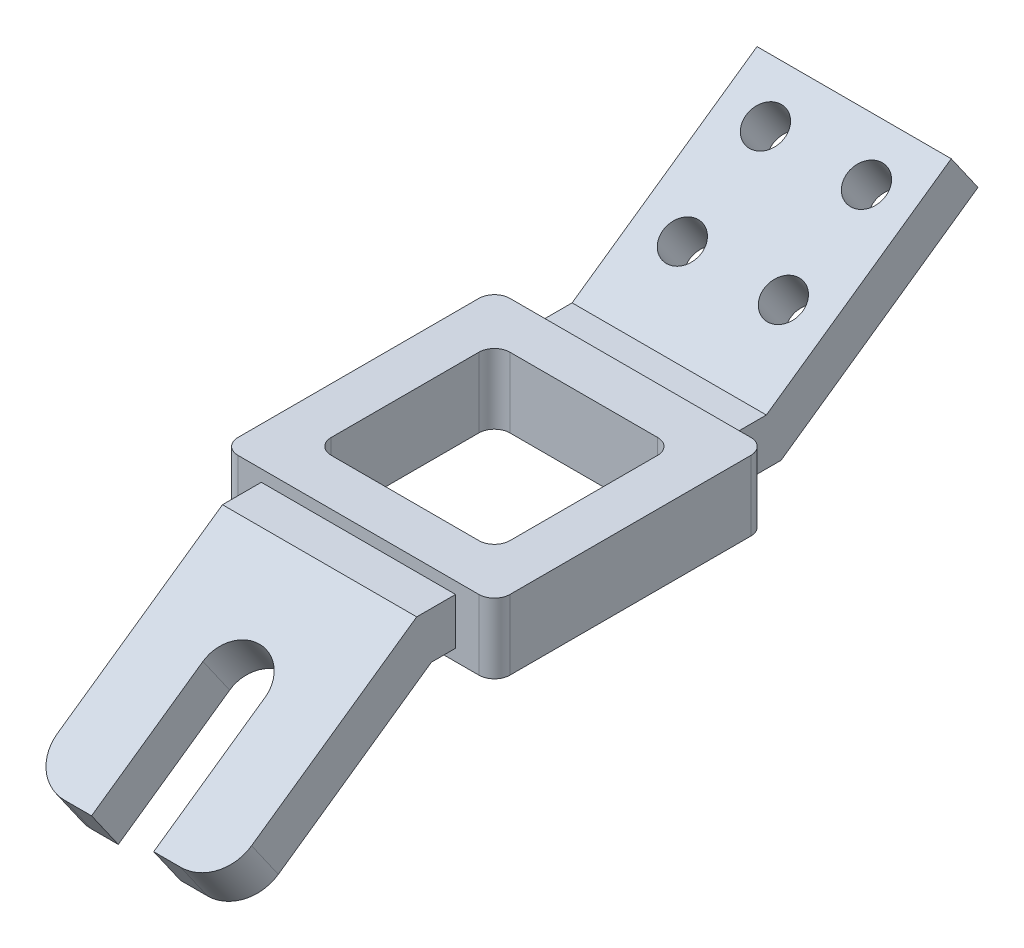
ISO-10303-21;
HEADER;
FILE_DESCRIPTION(('STEP AP214'),'2;1');
FILE_NAME('part.step','',(''),(''),'','','');
FILE_SCHEMA(('AUTOMOTIVE_DESIGN { 1 0 10303 214 1 1 1 1 }'));
ENDSEC;
DATA;
#1=APPLICATION_CONTEXT('core data for automotive mechanical design processes');
#2=APPLICATION_PROTOCOL_DEFINITION('international standard','automotive_design',2000,#1);
#3=PRODUCT_CONTEXT('',#1,'mechanical');
#4=PRODUCT('Part','Part','',(#3));
#5=PRODUCT_RELATED_PRODUCT_CATEGORY('part','',(#4));
#6=PRODUCT_DEFINITION_FORMATION('','',#4);
#7=PRODUCT_DEFINITION_CONTEXT('part definition',#1,'design');
#8=PRODUCT_DEFINITION('design','',#6,#7);
#9=PRODUCT_DEFINITION_SHAPE('','',#8);
#10=(LENGTH_UNIT() NAMED_UNIT(*) SI_UNIT(.MILLI.,.METRE.));
#11=(NAMED_UNIT(*) PLANE_ANGLE_UNIT() SI_UNIT($,.RADIAN.));
#12=(NAMED_UNIT(*) SI_UNIT($,.STERADIAN.) SOLID_ANGLE_UNIT());
#13=UNCERTAINTY_MEASURE_WITH_UNIT(LENGTH_MEASURE(1.E-05),#10,'distance_accuracy_value','');
#14=(GEOMETRIC_REPRESENTATION_CONTEXT(3) GLOBAL_UNCERTAINTY_ASSIGNED_CONTEXT((#13)) GLOBAL_UNIT_ASSIGNED_CONTEXT((#10,
#11,#12)) REPRESENTATION_CONTEXT('',''));
#15=CARTESIAN_POINT('',(0.,0.,0.));
#16=DIRECTION('',(0.,0.,1.));
#17=DIRECTION('',(1.,0.,0.));
#18=AXIS2_PLACEMENT_3D('',#15,#16,#17);
#19=CARTESIAN_POINT('',(31.75,-49.9484630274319,115.198733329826));
#20=DIRECTION('',(0.,-0.573576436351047,0.819152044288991));
#21=DIRECTION('',(0.,-0.819152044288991,-0.573576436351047));
#22=AXIS2_PLACEMENT_3D('',#19,#20,#21);
#23=PLANE('',#22);
#24=DIRECTION('',(0.,0.819152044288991,0.573576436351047));
#25=VECTOR('',#24,1.);
#26=CARTESIAN_POINT('',(-10.16,-162.306932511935,36.5244860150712));
#27=LINE('',#26,#25);
#28=CARTESIAN_POINT('',(-10.16,-49.9484630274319,115.198733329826));
#29=VERTEX_POINT('',#28);
#30=CARTESIAN_POINT('',(-10.16,-37.4645858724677,123.940038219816));
#31=VERTEX_POINT('',#30);
#32=EDGE_CURVE('E404',#29,#31,#27,.T.);
#33=ORIENTED_EDGE('',*,*,#32,.T.);
#34=DIRECTION('',(-1.,0.,0.));
#35=VECTOR('',#34,1.);
#36=CARTESIAN_POINT('',(31.75,-37.4645858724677,123.940038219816));
#37=LINE('',#36,#35);
#38=CARTESIAN_POINT('',(-19.05,-37.4645858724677,123.940038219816));
#39=VERTEX_POINT('',#38);
#40=EDGE_CURVE('E273',#31,#39,#37,.T.);
#41=ORIENTED_EDGE('',*,*,#40,.T.);
#42=DIRECTION('',(0.,0.819152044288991,0.573576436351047));
#43=VECTOR('',#42,1.);
#44=CARTESIAN_POINT('',(-19.05,-49.9484630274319,115.198733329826));
#45=LINE('',#44,#43);
#46=CARTESIAN_POINT('',(-19.05,-49.9484630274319,115.198733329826));
#47=VERTEX_POINT('',#46);
#48=EDGE_CURVE('E387',#39,#47,#45,.F.);
#49=ORIENTED_EDGE('',*,*,#48,.T.);
#50=DIRECTION('',(-1.,0.,0.));
#51=VECTOR('',#50,1.);
#52=CARTESIAN_POINT('',(31.75,-49.9484630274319,115.198733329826));
#53=LINE('',#52,#51);
#54=EDGE_CURVE('E506',#29,#47,#53,.T.);
#55=ORIENTED_EDGE('',*,*,#54,.F.);
#56=EDGE_LOOP('',(#33,#41,#49,#55));
#57=FACE_BOUND('',#56,.T.);
#58=ADVANCED_FACE('F26',(#57),#23,.T.);
#59=CARTESIAN_POINT('',(31.75,7.62,57.15));
#60=DIRECTION('',(0.,1.,0.));
#61=DIRECTION('',(0.,0.,1.));
#62=AXIS2_PLACEMENT_3D('',#59,#60,#61);
#63=PLANE('',#62);
#64=DIRECTION('',(0.,0.,-1.));
#65=VECTOR('',#64,1.);
#66=CARTESIAN_POINT('',(31.75,7.62,57.15));
#67=LINE('',#66,#65);
#68=CARTESIAN_POINT('',(31.75,7.62,59.5525767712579));
#69=VERTEX_POINT('',#68);
#70=CARTESIAN_POINT('',(31.75,7.62,46.8525767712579));
#71=VERTEX_POINT('',#70);
#72=EDGE_CURVE('E491',#69,#71,#67,.T.);
#73=ORIENTED_EDGE('',*,*,#72,.T.);
#74=DIRECTION('',(-1.,0.,0.));
#75=VECTOR('',#74,1.);
#76=CARTESIAN_POINT('',(31.75,7.62,46.8525767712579));
#77=LINE('',#76,#75);
#78=CARTESIAN_POINT('',(-31.75,7.62,46.8525767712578));
#79=VERTEX_POINT('',#78);
#80=EDGE_CURVE('E456',#71,#79,#77,.T.);
#81=ORIENTED_EDGE('',*,*,#80,.T.);
#82=DIRECTION('',(0.,0.,-1.));
#83=VECTOR('',#82,1.);
#84=CARTESIAN_POINT('',(-31.75,7.62,57.15));
#85=LINE('',#84,#83);
#86=CARTESIAN_POINT('',(-31.75,7.62,59.5525767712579));
#87=VERTEX_POINT('',#86);
#88=EDGE_CURVE('E471',#87,#79,#85,.T.);
#89=ORIENTED_EDGE('',*,*,#88,.F.);
#90=DIRECTION('',(-1.,0.,0.));
#91=VECTOR('',#90,1.);
#92=CARTESIAN_POINT('',(31.75,7.62,59.5525767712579));
#93=LINE('',#92,#91);
#94=EDGE_CURVE('E272',#69,#87,#93,.T.);
#95=ORIENTED_EDGE('',*,*,#94,.F.);
#96=EDGE_LOOP('',(#73,#81,#89,#95));
#97=FACE_BOUND('',#96,.T.);
#98=ADVANCED_FACE('F519',(#97),#63,.T.);
#99=CARTESIAN_POINT('',(31.75,-7.62,57.15));
#100=DIRECTION('',(0.,1.,0.));
#101=DIRECTION('',(0.,0.,1.));
#102=AXIS2_PLACEMENT_3D('',#99,#100,#101);
#103=PLANE('',#102);
#104=DIRECTION('',(-1.,0.,0.));
#105=VECTOR('',#104,1.);
#106=CARTESIAN_POINT('',(31.75,-7.62,46.8525767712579));
#107=LINE('',#106,#105);
#108=CARTESIAN_POINT('',(31.75,-7.62,46.8525767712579));
#109=VERTEX_POINT('',#108);
#110=CARTESIAN_POINT('',(-31.75,-7.62,46.8525767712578));
#111=VERTEX_POINT('',#110);
#112=EDGE_CURVE('E454',#109,#111,#107,.T.);
#113=ORIENTED_EDGE('',*,*,#112,.F.);
#114=DIRECTION('',(0.,0.,-1.));
#115=VECTOR('',#114,1.);
#116=CARTESIAN_POINT('',(31.75,-7.62,57.15));
#117=LINE('',#116,#115);
#118=CARTESIAN_POINT('',(31.75,-7.62,54.7474232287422));
#119=VERTEX_POINT('',#118);
#120=EDGE_CURVE('E499',#119,#109,#117,.T.);
#121=ORIENTED_EDGE('',*,*,#120,.F.);
#122=DIRECTION('',(-1.,0.,0.));
#123=VECTOR('',#122,1.);
#124=CARTESIAN_POINT('',(31.75,-7.62,54.7474232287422));
#125=LINE('',#124,#123);
#126=CARTESIAN_POINT('',(-31.75,-7.62,54.7474232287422));
#127=VERTEX_POINT('',#126);
#128=EDGE_CURVE('E504',#119,#127,#125,.T.);
#129=ORIENTED_EDGE('',*,*,#128,.T.);
#130=DIRECTION('',(0.,0.,-1.));
#131=VECTOR('',#130,1.);
#132=CARTESIAN_POINT('',(-31.75,-7.62,57.15));
#133=LINE('',#132,#131);
#134=EDGE_CURVE('E479',#127,#111,#133,.T.);
#135=ORIENTED_EDGE('',*,*,#134,.T.);
#136=EDGE_LOOP('',(#113,#121,#129,#135));
#137=FACE_BOUND('',#136,.T.);
#138=ADVANCED_FACE('F622',(#137),#103,.F.);
#139=CARTESIAN_POINT('',(31.75,37.4645858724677,-123.940038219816));
#140=DIRECTION('',(-1.,0.,0.));
#141=DIRECTION('',(0.,0.,1.));
#142=AXIS2_PLACEMENT_3D('',#139,#140,#141);
#143=PLANE('',#142);
#144=DIRECTION('',(0.,0.573576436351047,-0.819152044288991));
#145=VECTOR('',#144,1.);
#146=CARTESIAN_POINT('',(31.75,-37.4645858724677,123.940038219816));
#147=LINE('',#146,#145);
#148=CARTESIAN_POINT('',(31.75,-30.1801651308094,113.536807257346));
#149=VERTEX_POINT('',#148);
#150=EDGE_CURVE('E494',#149,#69,#147,.T.);
#151=ORIENTED_EDGE('',*,*,#150,.F.);
#152=DIRECTION('',(0.,0.819152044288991,0.573576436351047));
#153=VECTOR('',#152,1.);
#154=CARTESIAN_POINT('',(31.75,-42.6640422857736,104.795502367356));
#155=LINE('',#154,#153);
#156=CARTESIAN_POINT('',(31.75,-42.6640422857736,104.795502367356));
#157=VERTEX_POINT('',#156);
#158=EDGE_CURVE('E49',#149,#157,#155,.F.);
#159=ORIENTED_EDGE('',*,*,#158,.T.);
#160=DIRECTION('',(0.,0.573576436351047,-0.819152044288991));
#161=VECTOR('',#160,1.);
#162=CARTESIAN_POINT('',(31.75,-49.9484630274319,115.198733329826));
#163=LINE('',#162,#161);
#164=EDGE_CURVE('E496',#157,#119,#163,.T.);
#165=ORIENTED_EDGE('',*,*,#164,.T.);
#166=ORIENTED_EDGE('',*,*,#120,.T.);
#167=DIRECTION('',(0.,-1.,0.));
#168=VECTOR('',#167,1.);
#169=CARTESIAN_POINT('',(31.75,37.4645858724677,46.8525767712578));
#170=LINE('',#169,#168);
#171=EDGE_CURVE('E459',#71,#109,#170,.T.);
#172=ORIENTED_EDGE('',*,*,#171,.F.);
#173=ORIENTED_EDGE('',*,*,#72,.F.);
#174=EDGE_LOOP('',(#151,#159,#165,#166,#172,#173));
#175=FACE_BOUND('',#174,.T.);
#176=ADVANCED_FACE('F516',(#175),#143,.F.);
#177=CARTESIAN_POINT('',(-31.75,37.4645858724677,-123.940038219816));
#178=DIRECTION('',(-1.,0.,0.));
#179=DIRECTION('',(0.,0.,1.));
#180=AXIS2_PLACEMENT_3D('',#177,#178,#179);
#181=PLANE('',#180);
#182=DIRECTION('',(0.,0.573576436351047,-0.819152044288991));
#183=VECTOR('',#182,1.);
#184=CARTESIAN_POINT('',(-31.75,-49.9484630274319,115.198733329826));
#185=LINE('',#184,#183);
#186=CARTESIAN_POINT('',(-31.75,-42.6640422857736,104.795502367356));
#187=VERTEX_POINT('',#186);
#188=EDGE_CURVE('E476',#187,#127,#185,.T.);
#189=ORIENTED_EDGE('',*,*,#188,.F.);
#190=DIRECTION('',(0.,0.819152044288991,0.573576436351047));
#191=VECTOR('',#190,1.);
#192=CARTESIAN_POINT('',(-31.75,-96.3674755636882,67.1919535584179));
#193=LINE('',#192,#191);
#194=CARTESIAN_POINT('',(-31.75,-30.1801651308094,113.536807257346));
#195=VERTEX_POINT('',#194);
#196=EDGE_CURVE('E378',#187,#195,#193,.T.);
#197=ORIENTED_EDGE('',*,*,#196,.T.);
#198=DIRECTION('',(0.,0.573576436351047,-0.819152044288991));
#199=VECTOR('',#198,1.);
#200=CARTESIAN_POINT('',(-31.75,-37.4645858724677,123.940038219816));
#201=LINE('',#200,#199);
#202=EDGE_CURVE('E474',#195,#87,#201,.T.);
#203=ORIENTED_EDGE('',*,*,#202,.T.);
#204=ORIENTED_EDGE('',*,*,#88,.T.);
#205=DIRECTION('',(0.,-1.,0.));
#206=VECTOR('',#205,1.);
#207=CARTESIAN_POINT('',(-31.75,37.4645858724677,46.8525767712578));
#208=LINE('',#207,#206);
#209=EDGE_CURVE('E291',#79,#111,#208,.T.);
#210=ORIENTED_EDGE('',*,*,#209,.T.);
#211=ORIENTED_EDGE('',*,*,#134,.F.);
#212=EDGE_LOOP('',(#189,#197,#203,#204,#210,#211));
#213=FACE_BOUND('',#212,.T.);
#214=ADVANCED_FACE('F526',(#213),#181,.T.);
#215=CARTESIAN_POINT('',(31.75,-37.4645858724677,123.940038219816));
#216=DIRECTION('',(0.,0.819152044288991,0.573576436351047));
#217=DIRECTION('',(0.,-0.573576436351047,0.819152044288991));
#218=AXIS2_PLACEMENT_3D('',#215,#216,#217);
#219=PLANE('',#218);
#220=DIRECTION('',(0.,-0.573576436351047,0.819152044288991));
#221=VECTOR('',#220,1.);
#222=CARTESIAN_POINT('',(-10.16,-37.4645858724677,123.940038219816));
#223=LINE('',#222,#221);
#224=CARTESIAN_POINT('',(-10.16,-11.9691132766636,87.5287298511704));
#225=VERTEX_POINT('',#224);
#226=EDGE_CURVE('E257',#225,#31,#223,.T.);
#227=ORIENTED_EDGE('',*,*,#226,.F.);
#228=CARTESIAN_POINT('',(0.,-11.9691132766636,87.5287298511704));
#229=DIRECTION('',(0.,0.819152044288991,0.573576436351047));
#230=DIRECTION('',(0.,0.573576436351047,-0.819152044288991));
#231=AXIS2_PLACEMENT_3D('',#228,#229,#230);
#232=CIRCLE('',#231,10.16);
#233=CARTESIAN_POINT('',(10.16,-11.9691132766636,87.5287298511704));
#234=VERTEX_POINT('',#233);
#235=EDGE_CURVE('E265',#234,#225,#232,.T.);
#236=ORIENTED_EDGE('',*,*,#235,.F.);
#237=DIRECTION('',(0.,0.573576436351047,-0.819152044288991));
#238=VECTOR('',#237,1.);
#239=CARTESIAN_POINT('',(10.16,-11.9691132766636,87.5287298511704));
#240=LINE('',#239,#238);
#241=CARTESIAN_POINT('',(10.16,-37.4645858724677,123.940038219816));
#242=VERTEX_POINT('',#241);
#243=EDGE_CURVE('E249',#242,#234,#240,.T.);
#244=ORIENTED_EDGE('',*,*,#243,.F.);
#245=CARTESIAN_POINT('',(19.05,-37.4645858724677,123.940038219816));
#246=VERTEX_POINT('',#245);
#247=EDGE_CURVE('E263',#246,#242,#37,.T.);
#248=ORIENTED_EDGE('',*,*,#247,.F.);
#249=CARTESIAN_POINT('',(19.05,-30.1801651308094,113.536807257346));
#250=DIRECTION('',(0.,0.819152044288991,0.573576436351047));
#251=DIRECTION('',(0.,-0.573576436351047,0.819152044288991));
#252=AXIS2_PLACEMENT_3D('',#249,#250,#251);
#253=CIRCLE('',#252,12.7);
#254=EDGE_CURVE('E381',#246,#149,#253,.T.);
#255=ORIENTED_EDGE('',*,*,#254,.T.);
#256=ORIENTED_EDGE('',*,*,#150,.T.);
#257=ORIENTED_EDGE('',*,*,#94,.T.);
#258=ORIENTED_EDGE('',*,*,#202,.F.);
#259=CARTESIAN_POINT('',(-19.05,-30.1801651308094,113.536807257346));
#260=DIRECTION('',(0.,0.819152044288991,0.573576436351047));
#261=DIRECTION('',(0.,-0.573576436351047,0.819152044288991));
#262=AXIS2_PLACEMENT_3D('',#259,#260,#261);
#263=CIRCLE('',#262,12.7);
#264=EDGE_CURVE('E383',#195,#39,#263,.T.);
#265=ORIENTED_EDGE('',*,*,#264,.T.);
#266=ORIENTED_EDGE('',*,*,#40,.F.);
#267=EDGE_LOOP('',(#227,#236,#244,#248,#255,#256,#257,#258,#265,#266));
#268=FACE_BOUND('',#267,.T.);
#269=ADVANCED_FACE('F262',(#268),#219,.T.);
#270=DIRECTION('',(0.,0.819152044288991,0.573576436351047));
#271=VECTOR('',#270,1.);
#272=CARTESIAN_POINT('',(10.16,-162.306932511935,36.5244860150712));
#273=LINE('',#272,#271);
#274=CARTESIAN_POINT('',(10.16,-49.9484630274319,115.198733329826));
#275=VERTEX_POINT('',#274);
#276=EDGE_CURVE('E246',#275,#242,#273,.T.);
#277=ORIENTED_EDGE('',*,*,#276,.F.);
#278=CARTESIAN_POINT('',(19.05,-49.9484630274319,115.198733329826));
#279=VERTEX_POINT('',#278);
#280=EDGE_CURVE('E278',#279,#275,#53,.T.);
#281=ORIENTED_EDGE('',*,*,#280,.F.);
#282=DIRECTION('',(0.,0.819152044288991,0.573576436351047));
#283=VECTOR('',#282,1.);
#284=CARTESIAN_POINT('',(19.05,-37.4645858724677,123.940038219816));
#285=LINE('',#284,#283);
#286=EDGE_CURVE('E271',#279,#246,#285,.T.);
#287=ORIENTED_EDGE('',*,*,#286,.T.);
#288=ORIENTED_EDGE('',*,*,#247,.T.);
#289=EDGE_LOOP('',(#277,#281,#287,#288));
#290=FACE_BOUND('',#289,.T.);
#291=ADVANCED_FACE('F269',(#290),#23,.T.);
#292=CARTESIAN_POINT('',(31.75,-49.9484630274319,115.198733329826));
#293=DIRECTION('',(0.,0.819152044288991,0.573576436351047));
#294=DIRECTION('',(0.,-0.573576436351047,0.819152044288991));
#295=AXIS2_PLACEMENT_3D('',#292,#293,#294);
#296=PLANE('',#295);
#297=CARTESIAN_POINT('',(0.,-24.4529904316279,78.7874249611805));
#298=DIRECTION('',(0.,0.819152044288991,0.573576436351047));
#299=DIRECTION('',(0.,-0.573576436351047,0.819152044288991));
#300=AXIS2_PLACEMENT_3D('',#297,#298,#299);
#301=CIRCLE('',#300,10.16);
#302=CARTESIAN_POINT('',(10.16,-24.4529904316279,78.7874249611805));
#303=VERTEX_POINT('',#302);
#304=CARTESIAN_POINT('',(-10.16,-24.4529904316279,78.7874249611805));
#305=VERTEX_POINT('',#304);
#306=EDGE_CURVE('E34',#303,#305,#301,.T.);
#307=ORIENTED_EDGE('',*,*,#306,.T.);
#308=DIRECTION('',(0.,-0.573576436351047,0.819152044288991));
#309=VECTOR('',#308,1.);
#310=CARTESIAN_POINT('',(-10.16,-49.9484630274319,115.198733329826));
#311=LINE('',#310,#309);
#312=EDGE_CURVE('E11',#305,#29,#311,.T.);
#313=ORIENTED_EDGE('',*,*,#312,.T.);
#314=ORIENTED_EDGE('',*,*,#54,.T.);
#315=CARTESIAN_POINT('',(-19.05,-42.6640422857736,104.795502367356));
#316=DIRECTION('',(0.,0.819152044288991,0.573576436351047));
#317=DIRECTION('',(0.,-0.573576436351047,0.819152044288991));
#318=AXIS2_PLACEMENT_3D('',#315,#316,#317);
#319=CIRCLE('',#318,12.7);
#320=EDGE_CURVE('E392',#47,#187,#319,.F.);
#321=ORIENTED_EDGE('',*,*,#320,.T.);
#322=ORIENTED_EDGE('',*,*,#188,.T.);
#323=ORIENTED_EDGE('',*,*,#128,.F.);
#324=ORIENTED_EDGE('',*,*,#164,.F.);
#325=CARTESIAN_POINT('',(19.05,-42.6640422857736,104.795502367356));
#326=DIRECTION('',(0.,0.819152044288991,0.573576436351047));
#327=DIRECTION('',(0.,-0.573576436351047,0.819152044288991));
#328=AXIS2_PLACEMENT_3D('',#325,#326,#327);
#329=CIRCLE('',#328,12.7);
#330=EDGE_CURVE('E390',#157,#279,#329,.F.);
#331=ORIENTED_EDGE('',*,*,#330,.T.);
#332=ORIENTED_EDGE('',*,*,#280,.T.);
#333=DIRECTION('',(0.,0.573576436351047,-0.819152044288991));
#334=VECTOR('',#333,1.);
#335=CARTESIAN_POINT('',(10.16,-49.9484630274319,115.198733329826));
#336=LINE('',#335,#334);
#337=EDGE_CURVE('E252',#275,#303,#336,.T.);
#338=ORIENTED_EDGE('',*,*,#337,.T.);
#339=EDGE_LOOP('',(#307,#313,#314,#321,#322,#323,#324,#331,#332,#338));
#340=FACE_BOUND('',#339,.T.);
#341=ADVANCED_FACE('F397',(#340),#296,.F.);
#342=CARTESIAN_POINT('',(-44.45,11.43,46.8525767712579));
#343=DIRECTION('',(0.,0.,-1.));
#344=DIRECTION('',(-1.,0.,0.));
#345=AXIS2_PLACEMENT_3D('',#342,#343,#344);
#346=PLANE('',#345);
#347=DIRECTION('',(1.,0.,0.));
#348=VECTOR('',#347,1.);
#349=CARTESIAN_POINT('',(-44.45,11.43,46.8525767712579));
#350=LINE('',#349,#348);
#351=CARTESIAN_POINT('',(-39.37,11.43,46.8525767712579));
#352=VERTEX_POINT('',#351);
#353=CARTESIAN_POINT('',(39.37,11.43,46.8525767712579));
#354=VERTEX_POINT('',#353);
#355=EDGE_CURVE('E438',#352,#354,#350,.T.);
#356=ORIENTED_EDGE('',*,*,#355,.F.);
#357=DIRECTION('',(0.,-1.,0.));
#358=VECTOR('',#357,1.);
#359=CARTESIAN_POINT('',(-39.37,11.43,46.8525767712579));
#360=LINE('',#359,#358);
#361=CARTESIAN_POINT('',(-39.37,-11.43,46.8525767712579));
#362=VERTEX_POINT('',#361);
#363=EDGE_CURVE('E322',#352,#362,#360,.T.);
#364=ORIENTED_EDGE('',*,*,#363,.T.);
#365=DIRECTION('',(1.,0.,0.));
#366=VECTOR('',#365,1.);
#367=CARTESIAN_POINT('',(-44.45,-11.43,46.8525767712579));
#368=LINE('',#367,#366);
#369=CARTESIAN_POINT('',(39.37,-11.43,46.8525767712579));
#370=VERTEX_POINT('',#369);
#371=EDGE_CURVE('E426',#362,#370,#368,.T.);
#372=ORIENTED_EDGE('',*,*,#371,.T.);
#373=DIRECTION('',(0.,-1.,0.));
#374=VECTOR('',#373,1.);
#375=CARTESIAN_POINT('',(39.37,11.43,46.8525767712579));
#376=LINE('',#375,#374);
#377=EDGE_CURVE('E320',#370,#354,#376,.F.);
#378=ORIENTED_EDGE('',*,*,#377,.T.);
#379=EDGE_LOOP('',(#356,#364,#372,#378));
#380=FACE_BOUND('',#379,.T.);
#381=ORIENTED_EDGE('',*,*,#80,.F.);
#382=ORIENTED_EDGE('',*,*,#171,.T.);
#383=ORIENTED_EDGE('',*,*,#112,.T.);
#384=ORIENTED_EDGE('',*,*,#209,.F.);
#385=EDGE_LOOP('',(#381,#382,#383,#384));
#386=FACE_BOUND('',#385,.T.);
#387=ADVANCED_FACE('F601',(#380,#386),#346,.F.);
#388=CARTESIAN_POINT('',(-44.45,11.43,-42.0474232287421));
#389=DIRECTION('',(0.,0.,1.));
#390=DIRECTION('',(1.,0.,0.));
#391=AXIS2_PLACEMENT_3D('',#388,#389,#390);
#392=PLANE('',#391);
#393=DIRECTION('',(-1.,0.,0.));
#394=VECTOR('',#393,1.);
#395=CARTESIAN_POINT('',(-44.45,-11.43,-42.0474232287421));
#396=LINE('',#395,#394);
#397=CARTESIAN_POINT('',(39.37,-11.43,-42.0474232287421));
#398=VERTEX_POINT('',#397);
#399=CARTESIAN_POINT('',(-39.37,-11.43,-42.0474232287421));
#400=VERTEX_POINT('',#399);
#401=EDGE_CURVE('E432',#398,#400,#396,.T.);
#402=ORIENTED_EDGE('',*,*,#401,.T.);
#403=DIRECTION('',(0.,-1.,0.));
#404=VECTOR('',#403,1.);
#405=CARTESIAN_POINT('',(-39.37,11.43,-42.0474232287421));
#406=LINE('',#405,#404);
#407=CARTESIAN_POINT('',(-39.37,11.43,-42.0474232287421));
#408=VERTEX_POINT('',#407);
#409=EDGE_CURVE('E310',#400,#408,#406,.F.);
#410=ORIENTED_EDGE('',*,*,#409,.T.);
#411=DIRECTION('',(-1.,0.,0.));
#412=VECTOR('',#411,1.);
#413=CARTESIAN_POINT('',(-44.45,11.43,-42.0474232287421));
#414=LINE('',#413,#412);
#415=CARTESIAN_POINT('',(39.37,11.43,-42.0474232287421));
#416=VERTEX_POINT('',#415);
#417=EDGE_CURVE('E444',#416,#408,#414,.T.);
#418=ORIENTED_EDGE('',*,*,#417,.F.);
#419=DIRECTION('',(0.,-1.,0.));
#420=VECTOR('',#419,1.);
#421=CARTESIAN_POINT('',(39.37,11.43,-42.0474232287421));
#422=LINE('',#421,#420);
#423=EDGE_CURVE('E307',#416,#398,#422,.T.);
#424=ORIENTED_EDGE('',*,*,#423,.T.);
#425=EDGE_LOOP('',(#402,#410,#418,#424));
#426=FACE_BOUND('',#425,.T.);
#427=DIRECTION('',(1.,0.,0.));
#428=VECTOR('',#427,1.);
#429=CARTESIAN_POINT('',(31.75,-7.62,-42.0474232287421));
#430=LINE('',#429,#428);
#431=CARTESIAN_POINT('',(-31.75,-7.62,-42.0474232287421));
#432=VERTEX_POINT('',#431);
#433=CARTESIAN_POINT('',(31.75,-7.62,-42.0474232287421));
#434=VERTEX_POINT('',#433);
#435=EDGE_CURVE('E447',#432,#434,#430,.T.);
#436=ORIENTED_EDGE('',*,*,#435,.T.);
#437=DIRECTION('',(0.,1.,0.));
#438=VECTOR('',#437,1.);
#439=CARTESIAN_POINT('',(31.75,37.4645858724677,-42.0474232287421));
#440=LINE('',#439,#438);
#441=CARTESIAN_POINT('',(31.75,7.62,-42.0474232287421));
#442=VERTEX_POINT('',#441);
#443=EDGE_CURVE('E452',#434,#442,#440,.T.);
#444=ORIENTED_EDGE('',*,*,#443,.T.);
#445=DIRECTION('',(1.,0.,0.));
#446=VECTOR('',#445,1.);
#447=CARTESIAN_POINT('',(31.75,7.62,-42.0474232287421));
#448=LINE('',#447,#446);
#449=CARTESIAN_POINT('',(-31.75,7.62,-42.0474232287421));
#450=VERTEX_POINT('',#449);
#451=EDGE_CURVE('E449',#450,#442,#448,.T.);
#452=ORIENTED_EDGE('',*,*,#451,.F.);
#453=DIRECTION('',(0.,1.,0.));
#454=VECTOR('',#453,1.);
#455=CARTESIAN_POINT('',(-31.75,37.4645858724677,-42.0474232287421));
#456=LINE('',#455,#454);
#457=EDGE_CURVE('E288',#432,#450,#456,.T.);
#458=ORIENTED_EDGE('',*,*,#457,.F.);
#459=EDGE_LOOP('',(#436,#444,#452,#458));
#460=FACE_BOUND('',#459,.T.);
#461=ADVANCED_FACE('F598',(#426,#460),#392,.F.);
#462=CARTESIAN_POINT('',(-44.45,11.43,-42.0474232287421));
#463=DIRECTION('',(1.,0.,0.));
#464=DIRECTION('',(0.,0.,-1.));
#465=AXIS2_PLACEMENT_3D('',#462,#463,#464);
#466=PLANE('',#465);
#467=DIRECTION('',(0.,0.,1.));
#468=VECTOR('',#467,1.);
#469=CARTESIAN_POINT('',(-44.45,11.43,-42.0474232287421));
#470=LINE('',#469,#468);
#471=CARTESIAN_POINT('',(-44.45,11.43,-36.9674232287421));
#472=VERTEX_POINT('',#471);
#473=CARTESIAN_POINT('',(-44.45,11.43,41.7725767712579));
#474=VERTEX_POINT('',#473);
#475=EDGE_CURVE('E435',#472,#474,#470,.T.);
#476=ORIENTED_EDGE('',*,*,#475,.F.);
#477=DIRECTION('',(0.,-1.,0.));
#478=VECTOR('',#477,1.);
#479=CARTESIAN_POINT('',(-44.45,11.43,-36.9674232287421));
#480=LINE('',#479,#478);
#481=CARTESIAN_POINT('',(-44.45,-11.43,-36.9674232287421));
#482=VERTEX_POINT('',#481);
#483=EDGE_CURVE('E296',#472,#482,#480,.T.);
#484=ORIENTED_EDGE('',*,*,#483,.T.);
#485=DIRECTION('',(0.,0.,1.));
#486=VECTOR('',#485,1.);
#487=CARTESIAN_POINT('',(-44.45,-11.43,-42.0474232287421));
#488=LINE('',#487,#486);
#489=CARTESIAN_POINT('',(-44.45,-11.43,41.7725767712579));
#490=VERTEX_POINT('',#489);
#491=EDGE_CURVE('E423',#482,#490,#488,.T.);
#492=ORIENTED_EDGE('',*,*,#491,.T.);
#493=DIRECTION('',(0.,-1.,0.));
#494=VECTOR('',#493,1.);
#495=CARTESIAN_POINT('',(-44.45,11.43,41.7725767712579));
#496=LINE('',#495,#494);
#497=EDGE_CURVE('E294',#490,#474,#496,.F.);
#498=ORIENTED_EDGE('',*,*,#497,.T.);
#499=EDGE_LOOP('',(#476,#484,#492,#498));
#500=FACE_BOUND('',#499,.T.);
#501=ADVANCED_FACE('F600',(#500),#466,.F.);
#502=CARTESIAN_POINT('',(44.45,11.43,-42.0474232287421));
#503=DIRECTION('',(-1.,0.,0.));
#504=DIRECTION('',(0.,0.,1.));
#505=AXIS2_PLACEMENT_3D('',#502,#503,#504);
#506=PLANE('',#505);
#507=DIRECTION('',(0.,0.,-1.));
#508=VECTOR('',#507,1.);
#509=CARTESIAN_POINT('',(44.45,11.43,-42.0474232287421));
#510=LINE('',#509,#508);
#511=CARTESIAN_POINT('',(44.45,11.43,41.7725767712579));
#512=VERTEX_POINT('',#511);
#513=CARTESIAN_POINT('',(44.45,11.43,-36.9674232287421));
#514=VERTEX_POINT('',#513);
#515=EDGE_CURVE('E441',#512,#514,#510,.T.);
#516=ORIENTED_EDGE('',*,*,#515,.F.);
#517=DIRECTION('',(0.,-1.,0.));
#518=VECTOR('',#517,1.);
#519=CARTESIAN_POINT('',(44.45,11.43,41.7725767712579));
#520=LINE('',#519,#518);
#521=CARTESIAN_POINT('',(44.45,-11.43,41.7725767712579));
#522=VERTEX_POINT('',#521);
#523=EDGE_CURVE('E327',#512,#522,#520,.T.);
#524=ORIENTED_EDGE('',*,*,#523,.T.);
#525=DIRECTION('',(0.,0.,-1.));
#526=VECTOR('',#525,1.);
#527=CARTESIAN_POINT('',(44.45,-11.43,-42.0474232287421));
#528=LINE('',#527,#526);
#529=CARTESIAN_POINT('',(44.45,-11.43,-36.9674232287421));
#530=VERTEX_POINT('',#529);
#531=EDGE_CURVE('E429',#522,#530,#528,.T.);
#532=ORIENTED_EDGE('',*,*,#531,.T.);
#533=DIRECTION('',(0.,-1.,0.));
#534=VECTOR('',#533,1.);
#535=CARTESIAN_POINT('',(44.45,11.43,-36.9674232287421));
#536=LINE('',#535,#534);
#537=EDGE_CURVE('E325',#530,#514,#536,.F.);
#538=ORIENTED_EDGE('',*,*,#537,.T.);
#539=EDGE_LOOP('',(#516,#524,#532,#538));
#540=FACE_BOUND('',#539,.T.);
#541=ADVANCED_FACE('F608',(#540),#506,.F.);
#542=CARTESIAN_POINT('',(-44.45,11.43,46.8525767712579));
#543=DIRECTION('',(0.,1.,0.));
#544=DIRECTION('',(0.,0.,1.));
#545=AXIS2_PLACEMENT_3D('',#542,#543,#544);
#546=PLANE('',#545);
#547=DIRECTION('',(-1.,0.,0.));
#548=VECTOR('',#547,1.);
#549=CARTESIAN_POINT('',(29.21,11.43,-26.8074232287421));
#550=LINE('',#549,#548);
#551=CARTESIAN_POINT('',(24.13,11.43,-26.8074232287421));
#552=VERTEX_POINT('',#551);
#553=CARTESIAN_POINT('',(-24.13,11.43,-26.8074232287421));
#554=VERTEX_POINT('',#553);
#555=EDGE_CURVE('E407',#552,#554,#550,.T.);
#556=ORIENTED_EDGE('',*,*,#555,.F.);
#557=CARTESIAN_POINT('',(24.13,11.43,-21.7274232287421));
#558=DIRECTION('',(0.,1.,0.));
#559=DIRECTION('',(0.,0.,1.));
#560=AXIS2_PLACEMENT_3D('',#557,#558,#559);
#561=CIRCLE('',#560,5.08);
#562=CARTESIAN_POINT('',(29.21,11.43,-21.7274232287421));
#563=VERTEX_POINT('',#562);
#564=EDGE_CURVE('E374',#552,#563,#561,.F.);
#565=ORIENTED_EDGE('',*,*,#564,.T.);
#566=DIRECTION('',(0.,0.,-1.));
#567=VECTOR('',#566,1.);
#568=CARTESIAN_POINT('',(29.21,11.43,31.6125767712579));
#569=LINE('',#568,#567);
#570=CARTESIAN_POINT('',(29.21,11.43,26.5325767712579));
#571=VERTEX_POINT('',#570);
#572=EDGE_CURVE('E420',#571,#563,#569,.T.);
#573=ORIENTED_EDGE('',*,*,#572,.F.);
#574=CARTESIAN_POINT('',(24.13,11.43,26.5325767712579));
#575=DIRECTION('',(0.,1.,0.));
#576=DIRECTION('',(0.,0.,1.));
#577=AXIS2_PLACEMENT_3D('',#574,#575,#576);
#578=CIRCLE('',#577,5.08);
#579=CARTESIAN_POINT('',(24.13,11.43,31.6125767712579));
#580=VERTEX_POINT('',#579);
#581=EDGE_CURVE('E362',#571,#580,#578,.F.);
#582=ORIENTED_EDGE('',*,*,#581,.T.);
#583=DIRECTION('',(1.,0.,0.));
#584=VECTOR('',#583,1.);
#585=CARTESIAN_POINT('',(-29.21,11.43,31.6125767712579));
#586=LINE('',#585,#584);
#587=CARTESIAN_POINT('',(-24.13,11.43,31.6125767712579));
#588=VERTEX_POINT('',#587);
#589=EDGE_CURVE('E417',#588,#580,#586,.T.);
#590=ORIENTED_EDGE('',*,*,#589,.F.);
#591=CARTESIAN_POINT('',(-24.13,11.43,26.5325767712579));
#592=DIRECTION('',(0.,1.,0.));
#593=DIRECTION('',(0.,0.,1.));
#594=AXIS2_PLACEMENT_3D('',#591,#592,#593);
#595=CIRCLE('',#594,5.08);
#596=CARTESIAN_POINT('',(-29.21,11.43,26.5325767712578));
#597=VERTEX_POINT('',#596);
#598=EDGE_CURVE('E366',#588,#597,#595,.F.);
#599=ORIENTED_EDGE('',*,*,#598,.T.);
#600=DIRECTION('',(0.,0.,1.));
#601=VECTOR('',#600,1.);
#602=CARTESIAN_POINT('',(-29.21,11.43,-26.8074232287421));
#603=LINE('',#602,#601);
#604=CARTESIAN_POINT('',(-29.21,11.43,-21.7274232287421));
#605=VERTEX_POINT('',#604);
#606=EDGE_CURVE('E414',#605,#597,#603,.T.);
#607=ORIENTED_EDGE('',*,*,#606,.F.);
#608=CARTESIAN_POINT('',(-24.13,11.43,-21.7274232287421));
#609=DIRECTION('',(0.,1.,0.));
#610=DIRECTION('',(0.,0.,1.));
#611=AXIS2_PLACEMENT_3D('',#608,#609,#610);
#612=CIRCLE('',#611,5.08);
#613=EDGE_CURVE('E370',#605,#554,#612,.F.);
#614=ORIENTED_EDGE('',*,*,#613,.T.);
#615=EDGE_LOOP('',(#556,#565,#573,#582,#590,#599,#607,#614));
#616=FACE_BOUND('',#615,.T.);
#617=ORIENTED_EDGE('',*,*,#417,.T.);
#618=CARTESIAN_POINT('',(-39.37,11.43,-36.9674232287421));
#619=DIRECTION('',(0.,1.,0.));
#620=DIRECTION('',(0.,0.,1.));
#621=AXIS2_PLACEMENT_3D('',#618,#619,#620);
#622=CIRCLE('',#621,5.08);
#623=EDGE_CURVE('E318',#408,#472,#622,.T.);
#624=ORIENTED_EDGE('',*,*,#623,.T.);
#625=ORIENTED_EDGE('',*,*,#475,.T.);
#626=CARTESIAN_POINT('',(-39.37,11.43,41.7725767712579));
#627=DIRECTION('',(0.,1.,0.));
#628=DIRECTION('',(0.,0.,1.));
#629=AXIS2_PLACEMENT_3D('',#626,#627,#628);
#630=CIRCLE('',#629,5.08);
#631=EDGE_CURVE('E316',#474,#352,#630,.T.);
#632=ORIENTED_EDGE('',*,*,#631,.T.);
#633=ORIENTED_EDGE('',*,*,#355,.T.);
#634=CARTESIAN_POINT('',(39.37,11.43,41.7725767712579));
#635=DIRECTION('',(0.,1.,0.));
#636=DIRECTION('',(0.,0.,1.));
#637=AXIS2_PLACEMENT_3D('',#634,#635,#636);
#638=CIRCLE('',#637,5.08);
#639=EDGE_CURVE('E314',#354,#512,#638,.T.);
#640=ORIENTED_EDGE('',*,*,#639,.T.);
#641=ORIENTED_EDGE('',*,*,#515,.T.);
#642=CARTESIAN_POINT('',(39.37,11.43,-36.9674232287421));
#643=DIRECTION('',(0.,1.,0.));
#644=DIRECTION('',(0.,0.,1.));
#645=AXIS2_PLACEMENT_3D('',#642,#643,#644);
#646=CIRCLE('',#645,5.08);
#647=EDGE_CURVE('E312',#514,#416,#646,.T.);
#648=ORIENTED_EDGE('',*,*,#647,.T.);
#649=EDGE_LOOP('',(#617,#624,#625,#632,#633,#640,#641,#648));
#650=FACE_BOUND('',#649,.T.);
#651=ADVANCED_FACE('F644',(#616,#650),#546,.T.);
#652=CARTESIAN_POINT('',(-44.45,-11.43,46.8525767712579));
#653=DIRECTION('',(0.,1.,0.));
#654=DIRECTION('',(0.,0.,1.));
#655=AXIS2_PLACEMENT_3D('',#652,#653,#654);
#656=PLANE('',#655);
#657=DIRECTION('',(1.,0.,0.));
#658=VECTOR('',#657,1.);
#659=CARTESIAN_POINT('',(-44.45,-11.43,31.6125767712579));
#660=LINE('',#659,#658);
#661=CARTESIAN_POINT('',(-24.13,-11.43,31.6125767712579));
#662=VERTEX_POINT('',#661);
#663=CARTESIAN_POINT('',(24.13,-11.43,31.6125767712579));
#664=VERTEX_POINT('',#663);
#665=EDGE_CURVE('E333',#662,#664,#660,.T.);
#666=ORIENTED_EDGE('',*,*,#665,.T.);
#667=CARTESIAN_POINT('',(24.13,-11.43,26.5325767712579));
#668=DIRECTION('',(0.,1.,0.));
#669=DIRECTION('',(0.,0.,1.));
#670=AXIS2_PLACEMENT_3D('',#667,#668,#669);
#671=CIRCLE('',#670,5.08);
#672=CARTESIAN_POINT('',(29.21,-11.43,26.5325767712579));
#673=VERTEX_POINT('',#672);
#674=EDGE_CURVE('E364',#664,#673,#671,.T.);
#675=ORIENTED_EDGE('',*,*,#674,.T.);
#676=DIRECTION('',(0.,0.,-1.));
#677=VECTOR('',#676,1.);
#678=CARTESIAN_POINT('',(29.21,-11.43,46.8525767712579));
#679=LINE('',#678,#677);
#680=CARTESIAN_POINT('',(29.21,-11.43,-21.7274232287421));
#681=VERTEX_POINT('',#680);
#682=EDGE_CURVE('E336',#673,#681,#679,.T.);
#683=ORIENTED_EDGE('',*,*,#682,.T.);
#684=CARTESIAN_POINT('',(24.13,-11.43,-21.7274232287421));
#685=DIRECTION('',(0.,1.,0.));
#686=DIRECTION('',(0.,0.,1.));
#687=AXIS2_PLACEMENT_3D('',#684,#685,#686);
#688=CIRCLE('',#687,5.08);
#689=CARTESIAN_POINT('',(24.13,-11.43,-26.8074232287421));
#690=VERTEX_POINT('',#689);
#691=EDGE_CURVE('E376',#681,#690,#688,.T.);
#692=ORIENTED_EDGE('',*,*,#691,.T.);
#693=DIRECTION('',(-1.,0.,0.));
#694=VECTOR('',#693,1.);
#695=CARTESIAN_POINT('',(-44.45,-11.43,-26.8074232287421));
#696=LINE('',#695,#694);
#697=CARTESIAN_POINT('',(-24.13,-11.43,-26.8074232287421));
#698=VERTEX_POINT('',#697);
#699=EDGE_CURVE('E339',#690,#698,#696,.T.);
#700=ORIENTED_EDGE('',*,*,#699,.T.);
#701=CARTESIAN_POINT('',(-24.13,-11.43,-21.7274232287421));
#702=DIRECTION('',(0.,1.,0.));
#703=DIRECTION('',(0.,0.,1.));
#704=AXIS2_PLACEMENT_3D('',#701,#702,#703);
#705=CIRCLE('',#704,5.08);
#706=CARTESIAN_POINT('',(-29.21,-11.43,-21.7274232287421));
#707=VERTEX_POINT('',#706);
#708=EDGE_CURVE('E372',#698,#707,#705,.T.);
#709=ORIENTED_EDGE('',*,*,#708,.T.);
#710=DIRECTION('',(0.,0.,1.));
#711=VECTOR('',#710,1.);
#712=CARTESIAN_POINT('',(-29.21,-11.43,46.8525767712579));
#713=LINE('',#712,#711);
#714=CARTESIAN_POINT('',(-29.21,-11.43,26.5325767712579));
#715=VERTEX_POINT('',#714);
#716=EDGE_CURVE('E330',#707,#715,#713,.T.);
#717=ORIENTED_EDGE('',*,*,#716,.T.);
#718=CARTESIAN_POINT('',(-24.13,-11.43,26.5325767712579));
#719=DIRECTION('',(0.,1.,0.));
#720=DIRECTION('',(0.,0.,1.));
#721=AXIS2_PLACEMENT_3D('',#718,#719,#720);
#722=CIRCLE('',#721,5.08);
#723=EDGE_CURVE('E368',#715,#662,#722,.T.);
#724=ORIENTED_EDGE('',*,*,#723,.T.);
#725=EDGE_LOOP('',(#666,#675,#683,#692,#700,#709,#717,#724));
#726=FACE_BOUND('',#725,.T.);
#727=ORIENTED_EDGE('',*,*,#491,.F.);
#728=CARTESIAN_POINT('',(-39.37,-11.43,-36.9674232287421));
#729=DIRECTION('',(0.,1.,0.));
#730=DIRECTION('',(0.,0.,1.));
#731=AXIS2_PLACEMENT_3D('',#728,#729,#730);
#732=CIRCLE('',#731,5.08);
#733=EDGE_CURVE('E305',#482,#400,#732,.F.);
#734=ORIENTED_EDGE('',*,*,#733,.T.);
#735=ORIENTED_EDGE('',*,*,#401,.F.);
#736=CARTESIAN_POINT('',(39.37,-11.43,-36.9674232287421));
#737=DIRECTION('',(0.,1.,0.));
#738=DIRECTION('',(0.,0.,1.));
#739=AXIS2_PLACEMENT_3D('',#736,#737,#738);
#740=CIRCLE('',#739,5.08);
#741=EDGE_CURVE('E299',#398,#530,#740,.F.);
#742=ORIENTED_EDGE('',*,*,#741,.T.);
#743=ORIENTED_EDGE('',*,*,#531,.F.);
#744=CARTESIAN_POINT('',(39.37,-11.43,41.7725767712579));
#745=DIRECTION('',(0.,1.,0.));
#746=DIRECTION('',(0.,0.,1.));
#747=AXIS2_PLACEMENT_3D('',#744,#745,#746);
#748=CIRCLE('',#747,5.08);
#749=EDGE_CURVE('E301',#522,#370,#748,.F.);
#750=ORIENTED_EDGE('',*,*,#749,.T.);
#751=ORIENTED_EDGE('',*,*,#371,.F.);
#752=CARTESIAN_POINT('',(-39.37,-11.43,41.7725767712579));
#753=DIRECTION('',(0.,1.,0.));
#754=DIRECTION('',(0.,0.,1.));
#755=AXIS2_PLACEMENT_3D('',#752,#753,#754);
#756=CIRCLE('',#755,5.08);
#757=EDGE_CURVE('E303',#362,#490,#756,.F.);
#758=ORIENTED_EDGE('',*,*,#757,.T.);
#759=EDGE_LOOP('',(#727,#734,#735,#742,#743,#750,#751,#758));
#760=FACE_BOUND('',#759,.T.);
#761=ADVANCED_FACE('F638',(#726,#760),#656,.F.);
#762=CARTESIAN_POINT('',(31.75,-6.24193857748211,-61.520652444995));
#763=DIRECTION('',(0.,0.819152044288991,0.573576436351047));
#764=DIRECTION('',(0.,-0.573576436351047,0.819152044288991));
#765=AXIS2_PLACEMENT_3D('',#762,#763,#764);
#766=PLANE('',#765);
#767=CARTESIAN_POINT('',(-16.51,9.70496432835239,-84.2951900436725));
#768=DIRECTION('',(0.,0.819152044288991,0.573576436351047));
#769=DIRECTION('',(0.,-0.573576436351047,0.819152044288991));
#770=AXIS2_PLACEMENT_3D('',#767,#768,#769);
#771=CIRCLE('',#770,6.35);
#772=CARTESIAN_POINT('',(-16.51,6.06275395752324,-79.0935745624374));
#773=VERTEX_POINT('',#772);
#774=EDGE_CURVE('E551',#773,#773,#771,.T.);
#775=ORIENTED_EDGE('',*,*,#774,.T.);
#776=EDGE_LOOP('',(#775));
#777=FACE_BOUND('',#776,.T.);
#778=CARTESIAN_POINT('',(-16.51,28.7232809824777,-111.456161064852));
#779=DIRECTION('',(0.,0.819152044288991,0.573576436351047));
#780=DIRECTION('',(0.,-0.573576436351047,0.819152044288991));
#781=AXIS2_PLACEMENT_3D('',#778,#779,#780);
#782=CIRCLE('',#781,6.34999999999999);
#783=CARTESIAN_POINT('',(-16.51,25.0810706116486,-106.254545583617));
#784=VERTEX_POINT('',#783);
#785=EDGE_CURVE('E545',#784,#784,#782,.T.);
#786=ORIENTED_EDGE('',*,*,#785,.T.);
#787=EDGE_LOOP('',(#786));
#788=FACE_BOUND('',#787,.T.);
#789=CARTESIAN_POINT('',(16.51,9.70496432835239,-84.2951900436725));
#790=DIRECTION('',(0.,0.819152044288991,0.573576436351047));
#791=DIRECTION('',(0.,-0.573576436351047,0.819152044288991));
#792=AXIS2_PLACEMENT_3D('',#789,#790,#791);
#793=CIRCLE('',#792,6.35);
#794=CARTESIAN_POINT('',(16.51,6.06275395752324,-79.0935745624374));
#795=VERTEX_POINT('',#794);
#796=EDGE_CURVE('E539',#795,#795,#793,.T.);
#797=ORIENTED_EDGE('',*,*,#796,.T.);
#798=EDGE_LOOP('',(#797));
#799=FACE_BOUND('',#798,.T.);
#800=CARTESIAN_POINT('',(16.51,28.7232809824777,-111.456161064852));
#801=DIRECTION('',(0.,0.819152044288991,0.573576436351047));
#802=DIRECTION('',(0.,-0.573576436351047,0.819152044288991));
#803=AXIS2_PLACEMENT_3D('',#800,#801,#802);
#804=CIRCLE('',#803,6.34999999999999);
#805=CARTESIAN_POINT('',(16.51,25.0810706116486,-106.254545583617));
#806=VERTEX_POINT('',#805);
#807=EDGE_CURVE('E266',#806,#806,#804,.T.);
#808=ORIENTED_EDGE('',*,*,#807,.T.);
#809=EDGE_LOOP('',(#808));
#810=FACE_BOUND('',#809,.T.);
#811=DIRECTION('',(0.,0.573576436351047,-0.819152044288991));
#812=VECTOR('',#811,1.);
#813=CARTESIAN_POINT('',(-31.75,-6.24193857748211,-61.520652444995));
#814=LINE('',#813,#812);
#815=CARTESIAN_POINT('',(-31.75,-7.62,-59.5525767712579));
#816=VERTEX_POINT('',#815);
#817=CARTESIAN_POINT('',(-31.75,37.4645858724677,-123.940038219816));
#818=VERTEX_POINT('',#817);
#819=EDGE_CURVE('E461',#816,#818,#814,.T.);
#820=ORIENTED_EDGE('',*,*,#819,.T.);
#821=DIRECTION('',(-1.,0.,0.));
#822=VECTOR('',#821,1.);
#823=CARTESIAN_POINT('',(31.75,37.4645858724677,-123.940038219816));
#824=LINE('',#823,#822);
#825=CARTESIAN_POINT('',(31.75,37.4645858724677,-123.940038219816));
#826=VERTEX_POINT('',#825);
#827=EDGE_CURVE('E286',#826,#818,#824,.T.);
#828=ORIENTED_EDGE('',*,*,#827,.F.);
#829=DIRECTION('',(0.,0.573576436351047,-0.819152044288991));
#830=VECTOR('',#829,1.);
#831=CARTESIAN_POINT('',(31.75,-6.24193857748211,-61.520652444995));
#832=LINE('',#831,#830);
#833=CARTESIAN_POINT('',(31.75,-7.62,-59.5525767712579));
#834=VERTEX_POINT('',#833);
#835=EDGE_CURVE('E482',#834,#826,#832,.T.);
#836=ORIENTED_EDGE('',*,*,#835,.F.);
#837=DIRECTION('',(-1.,0.,0.));
#838=VECTOR('',#837,1.);
#839=CARTESIAN_POINT('',(31.75,-7.62,-59.5525767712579));
#840=LINE('',#839,#838);
#841=EDGE_CURVE('E502',#834,#816,#840,.T.);
#842=ORIENTED_EDGE('',*,*,#841,.T.);
#843=EDGE_LOOP('',(#820,#828,#836,#842));
#844=FACE_BOUND('',#843,.T.);
#845=ADVANCED_FACE('F28',(#777,#788,#799,#810,#844),#766,.F.);
#846=CARTESIAN_POINT('',(31.75,49.9484630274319,-115.198733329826));
#847=DIRECTION('',(0.,0.573576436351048,-0.819152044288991));
#848=DIRECTION('',(0.,0.819152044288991,0.573576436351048));
#849=AXIS2_PLACEMENT_3D('',#846,#847,#848);
#850=PLANE('',#849);
#851=DIRECTION('',(0.,-0.819152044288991,-0.573576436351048));
#852=VECTOR('',#851,1.);
#853=CARTESIAN_POINT('',(-31.75,49.9484630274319,-115.198733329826));
#854=LINE('',#853,#852);
#855=CARTESIAN_POINT('',(-31.75,49.9484630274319,-115.198733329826));
#856=VERTEX_POINT('',#855);
#857=EDGE_CURVE('E464',#856,#818,#854,.T.);
#858=ORIENTED_EDGE('',*,*,#857,.F.);
#859=DIRECTION('',(-1.,0.,0.));
#860=VECTOR('',#859,1.);
#861=CARTESIAN_POINT('',(31.75,49.9484630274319,-115.198733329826));
#862=LINE('',#861,#860);
#863=CARTESIAN_POINT('',(31.75,49.9484630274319,-115.198733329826));
#864=VERTEX_POINT('',#863);
#865=EDGE_CURVE('E284',#864,#856,#862,.T.);
#866=ORIENTED_EDGE('',*,*,#865,.F.);
#867=DIRECTION('',(0.,-0.819152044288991,-0.573576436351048));
#868=VECTOR('',#867,1.);
#869=CARTESIAN_POINT('',(31.75,49.9484630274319,-115.198733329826));
#870=LINE('',#869,#868);
#871=EDGE_CURVE('E484',#864,#826,#870,.T.);
#872=ORIENTED_EDGE('',*,*,#871,.T.);
#873=ORIENTED_EDGE('',*,*,#827,.T.);
#874=EDGE_LOOP('',(#858,#866,#872,#873));
#875=FACE_BOUND('',#874,.T.);
#876=ADVANCED_FACE('F565',(#875),#850,.T.);
#877=CARTESIAN_POINT('',(31.75,6.24193857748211,-52.779347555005));
#878=DIRECTION('',(0.,0.819152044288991,0.573576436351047));
#879=DIRECTION('',(0.,-0.573576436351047,0.819152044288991));
#880=AXIS2_PLACEMENT_3D('',#877,#878,#879);
#881=PLANE('',#880);
#882=CARTESIAN_POINT('',(-16.51,22.1888414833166,-75.5538851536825));
#883=DIRECTION('',(0.,0.819152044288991,0.573576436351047));
#884=DIRECTION('',(0.,-0.573576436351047,0.819152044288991));
#885=AXIS2_PLACEMENT_3D('',#882,#883,#884);
#886=CIRCLE('',#885,6.35);
#887=CARTESIAN_POINT('',(-16.51,18.5466311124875,-70.3522696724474));
#888=VERTEX_POINT('',#887);
#889=EDGE_CURVE('E554',#888,#888,#886,.T.);
#890=ORIENTED_EDGE('',*,*,#889,.F.);
#891=EDGE_LOOP('',(#890));
#892=FACE_BOUND('',#891,.T.);
#893=CARTESIAN_POINT('',(-16.51,41.207158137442,-102.714856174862));
#894=DIRECTION('',(0.,0.819152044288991,0.573576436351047));
#895=DIRECTION('',(0.,-0.573576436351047,0.819152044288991));
#896=AXIS2_PLACEMENT_3D('',#893,#894,#895);
#897=CIRCLE('',#896,6.34999999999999);
#898=CARTESIAN_POINT('',(-16.51,37.5649477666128,-97.5132406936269));
#899=VERTEX_POINT('',#898);
#900=EDGE_CURVE('E548',#899,#899,#897,.T.);
#901=ORIENTED_EDGE('',*,*,#900,.F.);
#902=EDGE_LOOP('',(#901));
#903=FACE_BOUND('',#902,.T.);
#904=CARTESIAN_POINT('',(16.51,22.1888414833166,-75.5538851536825));
#905=DIRECTION('',(0.,0.819152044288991,0.573576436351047));
#906=DIRECTION('',(0.,-0.573576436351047,0.819152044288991));
#907=AXIS2_PLACEMENT_3D('',#904,#905,#906);
#908=CIRCLE('',#907,6.35);
#909=CARTESIAN_POINT('',(16.51,18.5466311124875,-70.3522696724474));
#910=VERTEX_POINT('',#909);
#911=EDGE_CURVE('E542',#910,#910,#908,.T.);
#912=ORIENTED_EDGE('',*,*,#911,.F.);
#913=EDGE_LOOP('',(#912));
#914=FACE_BOUND('',#913,.T.);
#915=CARTESIAN_POINT('',(16.51,41.207158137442,-102.714856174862));
#916=DIRECTION('',(0.,0.819152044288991,0.573576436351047));
#917=DIRECTION('',(0.,-0.573576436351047,0.819152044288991));
#918=AXIS2_PLACEMENT_3D('',#915,#916,#917);
#919=CIRCLE('',#918,6.34999999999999);
#920=CARTESIAN_POINT('',(16.51,37.5649477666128,-97.5132406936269));
#921=VERTEX_POINT('',#920);
#922=EDGE_CURVE('E536',#921,#921,#919,.T.);
#923=ORIENTED_EDGE('',*,*,#922,.F.);
#924=EDGE_LOOP('',(#923));
#925=FACE_BOUND('',#924,.T.);
#926=DIRECTION('',(0.,0.573576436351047,-0.819152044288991));
#927=VECTOR('',#926,1.);
#928=CARTESIAN_POINT('',(-31.75,6.24193857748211,-52.779347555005));
#929=LINE('',#928,#927);
#930=CARTESIAN_POINT('',(-31.75,7.62,-54.7474232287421));
#931=VERTEX_POINT('',#930);
#932=EDGE_CURVE('E467',#931,#856,#929,.T.);
#933=ORIENTED_EDGE('',*,*,#932,.F.);
#934=DIRECTION('',(-1.,0.,0.));
#935=VECTOR('',#934,1.);
#936=CARTESIAN_POINT('',(31.75,7.62,-54.7474232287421));
#937=LINE('',#936,#935);
#938=CARTESIAN_POINT('',(31.75,7.62,-54.7474232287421));
#939=VERTEX_POINT('',#938);
#940=EDGE_CURVE('E276',#939,#931,#937,.T.);
#941=ORIENTED_EDGE('',*,*,#940,.F.);
#942=DIRECTION('',(0.,0.573576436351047,-0.819152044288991));
#943=VECTOR('',#942,1.);
#944=CARTESIAN_POINT('',(31.75,6.24193857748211,-52.779347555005));
#945=LINE('',#944,#943);
#946=EDGE_CURVE('E487',#939,#864,#945,.T.);
#947=ORIENTED_EDGE('',*,*,#946,.T.);
#948=ORIENTED_EDGE('',*,*,#865,.T.);
#949=EDGE_LOOP('',(#933,#941,#947,#948));
#950=FACE_BOUND('',#949,.T.);
#951=ADVANCED_FACE('F561',(#892,#903,#914,#925,#950),#881,.T.);
#952=ORIENTED_EDGE('',*,*,#443,.F.);
#953=EDGE_CURVE('E498',#434,#834,#117,.T.);
#954=ORIENTED_EDGE('',*,*,#953,.T.);
#955=ORIENTED_EDGE('',*,*,#835,.T.);
#956=ORIENTED_EDGE('',*,*,#871,.F.);
#957=ORIENTED_EDGE('',*,*,#946,.F.);
#958=EDGE_CURVE('E490',#442,#939,#67,.T.);
#959=ORIENTED_EDGE('',*,*,#958,.F.);
#960=EDGE_LOOP('',(#952,#954,#955,#956,#957,#959));
#961=FACE_BOUND('',#960,.T.);
#962=ADVANCED_FACE('F564',(#961),#143,.F.);
#963=EDGE_CURVE('E478',#432,#816,#133,.T.);
#964=ORIENTED_EDGE('',*,*,#963,.F.);
#965=ORIENTED_EDGE('',*,*,#457,.T.);
#966=EDGE_CURVE('E470',#450,#931,#85,.T.);
#967=ORIENTED_EDGE('',*,*,#966,.T.);
#968=ORIENTED_EDGE('',*,*,#932,.T.);
#969=ORIENTED_EDGE('',*,*,#857,.T.);
#970=ORIENTED_EDGE('',*,*,#819,.F.);
#971=EDGE_LOOP('',(#964,#965,#967,#968,#969,#970));
#972=FACE_BOUND('',#971,.T.);
#973=ADVANCED_FACE('F579',(#972),#181,.T.);
#974=ORIENTED_EDGE('',*,*,#435,.F.);
#975=ORIENTED_EDGE('',*,*,#963,.T.);
#976=ORIENTED_EDGE('',*,*,#841,.F.);
#977=ORIENTED_EDGE('',*,*,#953,.F.);
#978=EDGE_LOOP('',(#974,#975,#976,#977));
#979=FACE_BOUND('',#978,.T.);
#980=ADVANCED_FACE('F596',(#979),#103,.F.);
#981=ORIENTED_EDGE('',*,*,#966,.F.);
#982=ORIENTED_EDGE('',*,*,#451,.T.);
#983=ORIENTED_EDGE('',*,*,#958,.T.);
#984=ORIENTED_EDGE('',*,*,#940,.T.);
#985=EDGE_LOOP('',(#981,#982,#983,#984));
#986=FACE_BOUND('',#985,.T.);
#987=ADVANCED_FACE('F583',(#986),#63,.T.);
#988=CARTESIAN_POINT('',(-39.37,11.43,-36.9674232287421));
#989=DIRECTION('',(0.,-1.,0.));
#990=DIRECTION('',(0.,0.,-1.));
#991=AXIS2_PLACEMENT_3D('',#988,#989,#990);
#992=CYLINDRICAL_SURFACE('',#991,5.08);
#993=ORIENTED_EDGE('',*,*,#623,.F.);
#994=ORIENTED_EDGE('',*,*,#409,.F.);
#995=ORIENTED_EDGE('',*,*,#733,.F.);
#996=ORIENTED_EDGE('',*,*,#483,.F.);
#997=EDGE_LOOP('',(#993,#994,#995,#996));
#998=FACE_BOUND('',#997,.T.);
#999=ADVANCED_FACE('F720',(#998),#992,.T.);
#1000=CARTESIAN_POINT('',(-39.37,11.43,41.7725767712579));
#1001=DIRECTION('',(0.,-1.,0.));
#1002=DIRECTION('',(0.,0.,-1.));
#1003=AXIS2_PLACEMENT_3D('',#1000,#1001,#1002);
#1004=CYLINDRICAL_SURFACE('',#1003,5.08);
#1005=ORIENTED_EDGE('',*,*,#631,.F.);
#1006=ORIENTED_EDGE('',*,*,#497,.F.);
#1007=ORIENTED_EDGE('',*,*,#757,.F.);
#1008=ORIENTED_EDGE('',*,*,#363,.F.);
#1009=EDGE_LOOP('',(#1005,#1006,#1007,#1008));
#1010=FACE_BOUND('',#1009,.T.);
#1011=ADVANCED_FACE('F716',(#1010),#1004,.T.);
#1012=CARTESIAN_POINT('',(39.37,11.43,41.7725767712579));
#1013=DIRECTION('',(0.,-1.,0.));
#1014=DIRECTION('',(0.,0.,-1.));
#1015=AXIS2_PLACEMENT_3D('',#1012,#1013,#1014);
#1016=CYLINDRICAL_SURFACE('',#1015,5.08);
#1017=ORIENTED_EDGE('',*,*,#639,.F.);
#1018=ORIENTED_EDGE('',*,*,#377,.F.);
#1019=ORIENTED_EDGE('',*,*,#749,.F.);
#1020=ORIENTED_EDGE('',*,*,#523,.F.);
#1021=EDGE_LOOP('',(#1017,#1018,#1019,#1020));
#1022=FACE_BOUND('',#1021,.T.);
#1023=ADVANCED_FACE('F712',(#1022),#1016,.T.);
#1024=CARTESIAN_POINT('',(39.37,11.43,-36.9674232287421));
#1025=DIRECTION('',(0.,-1.,0.));
#1026=DIRECTION('',(0.,0.,-1.));
#1027=AXIS2_PLACEMENT_3D('',#1024,#1025,#1026);
#1028=CYLINDRICAL_SURFACE('',#1027,5.08);
#1029=ORIENTED_EDGE('',*,*,#647,.F.);
#1030=ORIENTED_EDGE('',*,*,#537,.F.);
#1031=ORIENTED_EDGE('',*,*,#741,.F.);
#1032=ORIENTED_EDGE('',*,*,#423,.F.);
#1033=EDGE_LOOP('',(#1029,#1030,#1031,#1032));
#1034=FACE_BOUND('',#1033,.T.);
#1035=ADVANCED_FACE('F708',(#1034),#1028,.T.);
#1036=CARTESIAN_POINT('',(29.21,-49.9484630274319,-26.8074232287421));
#1037=DIRECTION('',(0.,0.,-1.));
#1038=DIRECTION('',(-1.,0.,0.));
#1039=AXIS2_PLACEMENT_3D('',#1036,#1037,#1038);
#1040=PLANE('',#1039);
#1041=ORIENTED_EDGE('',*,*,#555,.T.);
#1042=DIRECTION('',(0.,1.,0.));
#1043=VECTOR('',#1042,1.);
#1044=CARTESIAN_POINT('',(-24.13,-11.43,-26.8074232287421));
#1045=LINE('',#1044,#1043);
#1046=EDGE_CURVE('E360',#554,#698,#1045,.F.);
#1047=ORIENTED_EDGE('',*,*,#1046,.T.);
#1048=ORIENTED_EDGE('',*,*,#699,.F.);
#1049=DIRECTION('',(0.,1.,0.));
#1050=VECTOR('',#1049,1.);
#1051=CARTESIAN_POINT('',(24.13,11.43,-26.8074232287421));
#1052=LINE('',#1051,#1050);
#1053=EDGE_CURVE('E357',#690,#552,#1052,.T.);
#1054=ORIENTED_EDGE('',*,*,#1053,.T.);
#1055=EDGE_LOOP('',(#1041,#1047,#1048,#1054));
#1056=FACE_BOUND('',#1055,.T.);
#1057=ADVANCED_FACE('F698',(#1056),#1040,.F.);
#1058=CARTESIAN_POINT('',(29.21,-49.9484630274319,31.6125767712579));
#1059=DIRECTION('',(1.,0.,0.));
#1060=DIRECTION('',(0.,0.,-1.));
#1061=AXIS2_PLACEMENT_3D('',#1058,#1059,#1060);
#1062=PLANE('',#1061);
#1063=ORIENTED_EDGE('',*,*,#682,.F.);
#1064=DIRECTION('',(0.,1.,0.));
#1065=VECTOR('',#1064,1.);
#1066=CARTESIAN_POINT('',(29.21,11.43,26.5325767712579));
#1067=LINE('',#1066,#1065);
#1068=EDGE_CURVE('E344',#673,#571,#1067,.T.);
#1069=ORIENTED_EDGE('',*,*,#1068,.T.);
#1070=ORIENTED_EDGE('',*,*,#572,.T.);
#1071=DIRECTION('',(0.,1.,0.));
#1072=VECTOR('',#1071,1.);
#1073=CARTESIAN_POINT('',(29.21,-11.43,-21.7274232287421));
#1074=LINE('',#1073,#1072);
#1075=EDGE_CURVE('E342',#563,#681,#1074,.F.);
#1076=ORIENTED_EDGE('',*,*,#1075,.T.);
#1077=EDGE_LOOP('',(#1063,#1069,#1070,#1076));
#1078=FACE_BOUND('',#1077,.T.);
#1079=ADVANCED_FACE('F694',(#1078),#1062,.F.);
#1080=CARTESIAN_POINT('',(-29.21,-49.9484630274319,31.6125767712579));
#1081=DIRECTION('',(0.,0.,1.));
#1082=DIRECTION('',(1.,0.,0.));
#1083=AXIS2_PLACEMENT_3D('',#1080,#1081,#1082);
#1084=PLANE('',#1083);
#1085=ORIENTED_EDGE('',*,*,#589,.T.);
#1086=DIRECTION('',(0.,1.,0.));
#1087=VECTOR('',#1086,1.);
#1088=CARTESIAN_POINT('',(24.13,-11.43,31.6125767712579));
#1089=LINE('',#1088,#1087);
#1090=EDGE_CURVE('E350',#580,#664,#1089,.F.);
#1091=ORIENTED_EDGE('',*,*,#1090,.T.);
#1092=ORIENTED_EDGE('',*,*,#665,.F.);
#1093=DIRECTION('',(0.,1.,0.));
#1094=VECTOR('',#1093,1.);
#1095=CARTESIAN_POINT('',(-24.13,11.43,31.6125767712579));
#1096=LINE('',#1095,#1094);
#1097=EDGE_CURVE('E347',#662,#588,#1096,.T.);
#1098=ORIENTED_EDGE('',*,*,#1097,.T.);
#1099=EDGE_LOOP('',(#1085,#1091,#1092,#1098));
#1100=FACE_BOUND('',#1099,.T.);
#1101=ADVANCED_FACE('F697',(#1100),#1084,.F.);
#1102=CARTESIAN_POINT('',(-29.21,-49.9484630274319,-26.8074232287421));
#1103=DIRECTION('',(-1.,0.,0.));
#1104=DIRECTION('',(0.,0.,1.));
#1105=AXIS2_PLACEMENT_3D('',#1102,#1103,#1104);
#1106=PLANE('',#1105);
#1107=ORIENTED_EDGE('',*,*,#606,.T.);
#1108=DIRECTION('',(0.,1.,0.));
#1109=VECTOR('',#1108,1.);
#1110=CARTESIAN_POINT('',(-29.21,-11.43,26.5325767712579));
#1111=LINE('',#1110,#1109);
#1112=EDGE_CURVE('E355',#597,#715,#1111,.F.);
#1113=ORIENTED_EDGE('',*,*,#1112,.T.);
#1114=ORIENTED_EDGE('',*,*,#716,.F.);
#1115=DIRECTION('',(0.,1.,0.));
#1116=VECTOR('',#1115,1.);
#1117=CARTESIAN_POINT('',(-29.21,11.43,-21.7274232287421));
#1118=LINE('',#1117,#1116);
#1119=EDGE_CURVE('E352',#707,#605,#1118,.T.);
#1120=ORIENTED_EDGE('',*,*,#1119,.T.);
#1121=EDGE_LOOP('',(#1107,#1113,#1114,#1120));
#1122=FACE_BOUND('',#1121,.T.);
#1123=ADVANCED_FACE('F692',(#1122),#1106,.F.);
#1124=CARTESIAN_POINT('',(24.13,-49.9484630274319,26.5325767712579));
#1125=DIRECTION('',(0.,-1.,0.));
#1126=DIRECTION('',(0.,0.,-1.));
#1127=AXIS2_PLACEMENT_3D('',#1124,#1125,#1126);
#1128=CYLINDRICAL_SURFACE('',#1127,5.08);
#1129=ORIENTED_EDGE('',*,*,#674,.F.);
#1130=ORIENTED_EDGE('',*,*,#1090,.F.);
#1131=ORIENTED_EDGE('',*,*,#581,.F.);
#1132=ORIENTED_EDGE('',*,*,#1068,.F.);
#1133=EDGE_LOOP('',(#1129,#1130,#1131,#1132));
#1134=FACE_BOUND('',#1133,.T.);
#1135=ADVANCED_FACE('F688',(#1134),#1128,.F.);
#1136=CARTESIAN_POINT('',(-24.13,-49.9484630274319,26.5325767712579));
#1137=DIRECTION('',(0.,-1.,0.));
#1138=DIRECTION('',(0.,0.,-1.));
#1139=AXIS2_PLACEMENT_3D('',#1136,#1137,#1138);
#1140=CYLINDRICAL_SURFACE('',#1139,5.08);
#1141=ORIENTED_EDGE('',*,*,#723,.F.);
#1142=ORIENTED_EDGE('',*,*,#1112,.F.);
#1143=ORIENTED_EDGE('',*,*,#598,.F.);
#1144=ORIENTED_EDGE('',*,*,#1097,.F.);
#1145=EDGE_LOOP('',(#1141,#1142,#1143,#1144));
#1146=FACE_BOUND('',#1145,.T.);
#1147=ADVANCED_FACE('F684',(#1146),#1140,.F.);
#1148=CARTESIAN_POINT('',(-24.13,-49.9484630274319,-21.7274232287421));
#1149=DIRECTION('',(0.,-1.,0.));
#1150=DIRECTION('',(0.,0.,-1.));
#1151=AXIS2_PLACEMENT_3D('',#1148,#1149,#1150);
#1152=CYLINDRICAL_SURFACE('',#1151,5.08);
#1153=ORIENTED_EDGE('',*,*,#708,.F.);
#1154=ORIENTED_EDGE('',*,*,#1046,.F.);
#1155=ORIENTED_EDGE('',*,*,#613,.F.);
#1156=ORIENTED_EDGE('',*,*,#1119,.F.);
#1157=EDGE_LOOP('',(#1153,#1154,#1155,#1156));
#1158=FACE_BOUND('',#1157,.T.);
#1159=ADVANCED_FACE('F680',(#1158),#1152,.F.);
#1160=CARTESIAN_POINT('',(24.13,-49.9484630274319,-21.7274232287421));
#1161=DIRECTION('',(0.,-1.,0.));
#1162=DIRECTION('',(0.,0.,-1.));
#1163=AXIS2_PLACEMENT_3D('',#1160,#1161,#1162);
#1164=CYLINDRICAL_SURFACE('',#1163,5.08);
#1165=ORIENTED_EDGE('',*,*,#691,.F.);
#1166=ORIENTED_EDGE('',*,*,#1075,.F.);
#1167=ORIENTED_EDGE('',*,*,#564,.F.);
#1168=ORIENTED_EDGE('',*,*,#1053,.F.);
#1169=EDGE_LOOP('',(#1165,#1166,#1167,#1168));
#1170=FACE_BOUND('',#1169,.T.);
#1171=ADVANCED_FACE('F677',(#1170),#1164,.F.);
#1172=CARTESIAN_POINT('',(-19.05,-96.3674755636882,67.1919535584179));
#1173=DIRECTION('',(0.,0.819152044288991,0.573576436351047));
#1174=DIRECTION('',(0.,-0.573576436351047,0.819152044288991));
#1175=AXIS2_PLACEMENT_3D('',#1172,#1173,#1174);
#1176=CYLINDRICAL_SURFACE('',#1175,12.7);
#1177=ORIENTED_EDGE('',*,*,#320,.F.);
#1178=ORIENTED_EDGE('',*,*,#48,.F.);
#1179=ORIENTED_EDGE('',*,*,#264,.F.);
#1180=ORIENTED_EDGE('',*,*,#196,.F.);
#1181=EDGE_LOOP('',(#1177,#1178,#1179,#1180));
#1182=FACE_BOUND('',#1181,.T.);
#1183=ADVANCED_FACE('F530',(#1182),#1176,.T.);
#1184=CARTESIAN_POINT('',(19.05,-42.6640422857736,104.795502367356));
#1185=DIRECTION('',(0.,-0.819152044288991,-0.573576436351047));
#1186=DIRECTION('',(0.,0.573576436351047,-0.819152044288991));
#1187=AXIS2_PLACEMENT_3D('',#1184,#1185,#1186);
#1188=CYLINDRICAL_SURFACE('',#1187,12.7);
#1189=ORIENTED_EDGE('',*,*,#330,.F.);
#1190=ORIENTED_EDGE('',*,*,#158,.F.);
#1191=ORIENTED_EDGE('',*,*,#254,.F.);
#1192=ORIENTED_EDGE('',*,*,#286,.F.);
#1193=EDGE_LOOP('',(#1189,#1190,#1191,#1192));
#1194=FACE_BOUND('',#1193,.T.);
#1195=ADVANCED_FACE('F513',(#1194),#1188,.T.);
#1196=CARTESIAN_POINT('',(-10.16,-162.306932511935,36.5244860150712));
#1197=DIRECTION('',(-1.,0.,0.));
#1198=DIRECTION('',(0.,0.,1.));
#1199=AXIS2_PLACEMENT_3D('',#1196,#1197,#1198);
#1200=PLANE('',#1199);
#1201=DIRECTION('',(0.,0.819152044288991,0.573576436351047));
#1202=VECTOR('',#1201,1.);
#1203=CARTESIAN_POINT('',(-10.16,-136.811459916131,0.1131776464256));
#1204=LINE('',#1203,#1202);
#1205=EDGE_CURVE('E402',#305,#225,#1204,.T.);
#1206=ORIENTED_EDGE('',*,*,#1205,.T.);
#1207=ORIENTED_EDGE('',*,*,#226,.T.);
#1208=ORIENTED_EDGE('',*,*,#32,.F.);
#1209=ORIENTED_EDGE('',*,*,#312,.F.);
#1210=EDGE_LOOP('',(#1206,#1207,#1208,#1209));
#1211=FACE_BOUND('',#1210,.T.);
#1212=ADVANCED_FACE('F669',(#1211),#1200,.F.);
#1213=CARTESIAN_POINT('',(0.,-136.811459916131,0.1131776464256));
#1214=DIRECTION('',(0.,0.819152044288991,0.573576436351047));
#1215=DIRECTION('',(0.,-0.573576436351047,0.819152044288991));
#1216=AXIS2_PLACEMENT_3D('',#1213,#1214,#1215);
#1217=CYLINDRICAL_SURFACE('',#1216,10.16);
#1218=DIRECTION('',(0.,0.819152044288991,0.573576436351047));
#1219=VECTOR('',#1218,1.);
#1220=CARTESIAN_POINT('',(10.16,-136.811459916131,0.1131776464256));
#1221=LINE('',#1220,#1219);
#1222=EDGE_CURVE('E41',#303,#234,#1221,.T.);
#1223=ORIENTED_EDGE('',*,*,#1222,.T.);
#1224=ORIENTED_EDGE('',*,*,#235,.T.);
#1225=ORIENTED_EDGE('',*,*,#1205,.F.);
#1226=ORIENTED_EDGE('',*,*,#306,.F.);
#1227=EDGE_LOOP('',(#1223,#1224,#1225,#1226));
#1228=FACE_BOUND('',#1227,.T.);
#1229=ADVANCED_FACE('F401',(#1228),#1217,.F.);
#1230=CARTESIAN_POINT('',(10.16,-136.811459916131,0.1131776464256));
#1231=DIRECTION('',(1.,0.,0.));
#1232=DIRECTION('',(0.,0.,-1.));
#1233=AXIS2_PLACEMENT_3D('',#1230,#1231,#1232);
#1234=PLANE('',#1233);
#1235=ORIENTED_EDGE('',*,*,#276,.T.);
#1236=ORIENTED_EDGE('',*,*,#243,.T.);
#1237=ORIENTED_EDGE('',*,*,#1222,.F.);
#1238=ORIENTED_EDGE('',*,*,#337,.F.);
#1239=EDGE_LOOP('',(#1235,#1236,#1237,#1238));
#1240=FACE_BOUND('',#1239,.T.);
#1241=ADVANCED_FACE('F248',(#1240),#1234,.F.);
#1242=CARTESIAN_POINT('',(16.51,-29.9317552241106,-152.526859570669));
#1243=DIRECTION('',(0.,0.819152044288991,0.573576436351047));
#1244=DIRECTION('',(0.,-0.573576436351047,0.819152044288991));
#1245=AXIS2_PLACEMENT_3D('',#1242,#1243,#1244);
#1246=CYLINDRICAL_SURFACE('',#1245,6.34999999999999);
#1247=ORIENTED_EDGE('',*,*,#922,.T.);
#1248=EDGE_LOOP('',(#1247));
#1249=FACE_BOUND('',#1248,.T.);
#1250=ORIENTED_EDGE('',*,*,#807,.F.);
#1251=EDGE_LOOP('',(#1250));
#1252=FACE_BOUND('',#1251,.T.);
#1253=ADVANCED_FACE('F655',(#1249,#1252),#1246,.F.);
#1254=CARTESIAN_POINT('',(16.51,-48.950071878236,-125.365888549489));
#1255=DIRECTION('',(0.,0.819152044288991,0.573576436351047));
#1256=DIRECTION('',(0.,-0.573576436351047,0.819152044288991));
#1257=AXIS2_PLACEMENT_3D('',#1254,#1255,#1256);
#1258=CYLINDRICAL_SURFACE('',#1257,6.35);
#1259=ORIENTED_EDGE('',*,*,#911,.T.);
#1260=EDGE_LOOP('',(#1259));
#1261=FACE_BOUND('',#1260,.T.);
#1262=ORIENTED_EDGE('',*,*,#796,.F.);
#1263=EDGE_LOOP('',(#1262));
#1264=FACE_BOUND('',#1263,.T.);
#1265=ADVANCED_FACE('F657',(#1261,#1264),#1258,.F.);
#1266=CARTESIAN_POINT('',(-16.51,-29.9317552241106,-152.526859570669));
#1267=DIRECTION('',(0.,0.819152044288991,0.573576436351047));
#1268=DIRECTION('',(0.,-0.573576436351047,0.819152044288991));
#1269=AXIS2_PLACEMENT_3D('',#1266,#1267,#1268);
#1270=CYLINDRICAL_SURFACE('',#1269,6.34999999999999);
#1271=ORIENTED_EDGE('',*,*,#900,.T.);
#1272=EDGE_LOOP('',(#1271));
#1273=FACE_BOUND('',#1272,.T.);
#1274=ORIENTED_EDGE('',*,*,#785,.F.);
#1275=EDGE_LOOP('',(#1274));
#1276=FACE_BOUND('',#1275,.T.);
#1277=ADVANCED_FACE('F663',(#1273,#1276),#1270,.F.);
#1278=CARTESIAN_POINT('',(-16.51,-48.950071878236,-125.365888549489));
#1279=DIRECTION('',(0.,0.819152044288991,0.573576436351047));
#1280=DIRECTION('',(0.,-0.573576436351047,0.819152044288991));
#1281=AXIS2_PLACEMENT_3D('',#1278,#1279,#1280);
#1282=CYLINDRICAL_SURFACE('',#1281,6.35);
#1283=ORIENTED_EDGE('',*,*,#889,.T.);
#1284=EDGE_LOOP('',(#1283));
#1285=FACE_BOUND('',#1284,.T.);
#1286=ORIENTED_EDGE('',*,*,#774,.F.);
#1287=EDGE_LOOP('',(#1286));
#1288=FACE_BOUND('',#1287,.T.);
#1289=ADVANCED_FACE('F558',(#1285,#1288),#1282,.F.);
#1290=CLOSED_SHELL('',(#58,#98,#138,#176,#214,#269,#291,#341,#387,#461,#501,#541,#651,#761,#845,
#876,#951,#962,#973,#980,#987,#999,#1011,#1023,#1035,#1057,#1079,#1101,#1123,#1135,#1147,#1159,
#1171,#1183,#1195,#1212,#1229,#1241,#1253,#1265,#1277,#1289));
#1291=MANIFOLD_SOLID_BREP('B2',#1290);
#1292=ADVANCED_BREP_SHAPE_REPRESENTATION('',(#18,#1291),#14);
#1293=SHAPE_DEFINITION_REPRESENTATION(#9,#1292);
ENDSEC;
END-ISO-10303-21;
